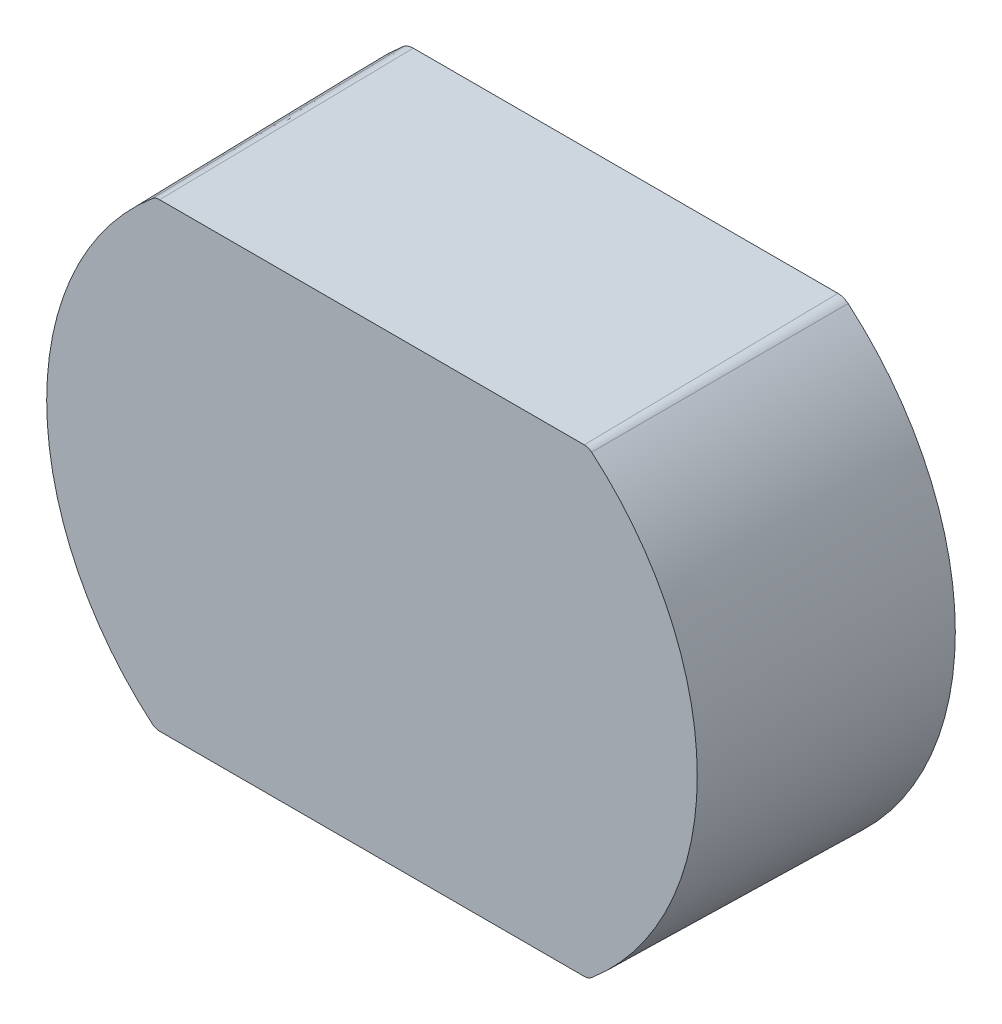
ISO-10303-21;
HEADER;
FILE_DESCRIPTION(('STEP AP214'),'2;1');
FILE_NAME('part.step','',(''),(''),'','','');
FILE_SCHEMA(('AUTOMOTIVE_DESIGN { 1 0 10303 214 1 1 1 1 }'));
ENDSEC;
DATA;
#1=APPLICATION_CONTEXT('core data for automotive mechanical design processes');
#2=APPLICATION_PROTOCOL_DEFINITION('international standard','automotive_design',2000,#1);
#3=PRODUCT_CONTEXT('',#1,'mechanical');
#4=PRODUCT('Part','Part','',(#3));
#5=PRODUCT_RELATED_PRODUCT_CATEGORY('part','',(#4));
#6=PRODUCT_DEFINITION_FORMATION('','',#4);
#7=PRODUCT_DEFINITION_CONTEXT('part definition',#1,'design');
#8=PRODUCT_DEFINITION('design','',#6,#7);
#9=PRODUCT_DEFINITION_SHAPE('','',#8);
#10=(LENGTH_UNIT() NAMED_UNIT(*) SI_UNIT(.MILLI.,.METRE.));
#11=(NAMED_UNIT(*) PLANE_ANGLE_UNIT() SI_UNIT($,.RADIAN.));
#12=(NAMED_UNIT(*) SI_UNIT($,.STERADIAN.) SOLID_ANGLE_UNIT());
#13=UNCERTAINTY_MEASURE_WITH_UNIT(LENGTH_MEASURE(1.E-05),#10,'distance_accuracy_value','');
#14=(GEOMETRIC_REPRESENTATION_CONTEXT(3) GLOBAL_UNCERTAINTY_ASSIGNED_CONTEXT((#13)) GLOBAL_UNIT_ASSIGNED_CONTEXT((#10,
#11,#12)) REPRESENTATION_CONTEXT('',''));
#15=CARTESIAN_POINT('',(0.,0.,0.));
#16=DIRECTION('',(0.,0.,1.));
#17=DIRECTION('',(1.,0.,0.));
#18=AXIS2_PLACEMENT_3D('',#15,#16,#17);
#19=CARTESIAN_POINT('',(-13.3937696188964,13.8001594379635,0.));
#20=DIRECTION('',(0.,0.,-1.));
#21=DIRECTION('',(-1.,0.,0.));
#22=AXIS2_PLACEMENT_3D('',#19,#20,#21);
#23=CONICAL_SURFACE('',#22,0.999837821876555,0.0174532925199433);
#24=CARTESIAN_POINT('',(-13.3937696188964,13.8001594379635,0.));
#25=DIRECTION('',(0.,0.,1.));
#26=DIRECTION('',(-1.,0.,0.));
#27=AXIS2_PLACEMENT_3D('',#24,#25,#26);
#28=CIRCLE('',#27,0.999837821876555);
#29=CARTESIAN_POINT('',(-13.393769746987,14.79999725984,0.));
#30=VERTEX_POINT('',#29);
#31=CARTESIAN_POINT('',(-14.0390708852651,14.563875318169,0.));
#32=VERTEX_POINT('',#31);
#33=EDGE_CURVE('E117',#30,#32,#28,.T.);
#34=ORIENTED_EDGE('',*,*,#33,.T.);
#35=DIRECTION('',(-0.0112638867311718,0.013330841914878,-0.999847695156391));
#36=VECTOR('',#35,1.);
#37=CARTESIAN_POINT('',(-14.0390708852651,14.563875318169,0.));
#38=LINE('',#37,#36);
#39=CARTESIAN_POINT('',(-13.858821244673,14.3505493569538,16.));
#40=VERTEX_POINT('',#39);
#41=EDGE_CURVE('E11',#40,#32,#38,.T.);
#42=ORIENTED_EDGE('',*,*,#41,.F.);
#43=CARTESIAN_POINT('',(-13.3937696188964,13.8001594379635,16.));
#44=DIRECTION('',(0.,0.,-1.));
#45=DIRECTION('',(-1.,0.,0.));
#46=AXIS2_PLACEMENT_3D('',#43,#44,#45);
#47=CIRCLE('',#46,0.720556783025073);
#48=CARTESIAN_POINT('',(-13.3937697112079,14.5207162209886,16.));
#49=VERTEX_POINT('',#48);
#50=EDGE_CURVE('E142',#49,#40,#47,.F.);
#51=ORIENTED_EDGE('',*,*,#50,.F.);
#52=DIRECTION('',(-2.23585101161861E-09,0.0174524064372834,-0.999847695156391));
#53=VECTOR('',#52,1.);
#54=CARTESIAN_POINT('',(-13.393769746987,14.7999972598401,0.));
#55=LINE('',#54,#53);
#56=EDGE_CURVE('E129',#49,#30,#55,.T.);
#57=ORIENTED_EDGE('',*,*,#56,.T.);
#58=EDGE_LOOP('',(#34,#42,#51,#57));
#59=FACE_BOUND('',#58,.T.);
#60=ADVANCED_FACE('F47',(#59),#23,.T.);
#61=CARTESIAN_POINT('',(-1.73333333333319,-1.63528065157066E-12,0.));
#62=DIRECTION('',(0.,0.,-1.));
#63=DIRECTION('',(1.,0.,0.));
#64=AXIS2_PLACEMENT_3D('',#61,#62,#63);
#65=CONICAL_SURFACE('',#64,19.0666630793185,0.0174532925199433);
#66=CARTESIAN_POINT('',(-1.73333333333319,-1.63528065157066E-12,0.));
#67=DIRECTION('',(0.,0.,1.));
#68=DIRECTION('',(1.,0.,0.));
#69=AXIS2_PLACEMENT_3D('',#66,#67,#68);
#70=CIRCLE('',#69,19.0666630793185);
#71=CARTESIAN_POINT('',(-14.0390708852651,-14.5638753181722,0.));
#72=VERTEX_POINT('',#71);
#73=EDGE_CURVE('E113',#32,#72,#70,.T.);
#74=ORIENTED_EDGE('',*,*,#73,.T.);
#75=DIRECTION('',(-0.0112638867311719,-0.0133308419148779,-0.999847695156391));
#76=VECTOR('',#75,1.);
#77=CARTESIAN_POINT('',(-14.0390708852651,-14.5638753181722,0.));
#78=LINE('',#77,#76);
#79=CARTESIAN_POINT('',(-13.858821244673,-14.350549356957,16.));
#80=VERTEX_POINT('',#79);
#81=EDGE_CURVE('E56',#80,#72,#78,.T.);
#82=ORIENTED_EDGE('',*,*,#81,.F.);
#83=CARTESIAN_POINT('',(-1.73333333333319,-1.63528065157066E-12,16.));
#84=DIRECTION('',(0.,0.,-1.));
#85=DIRECTION('',(-1.,0.,0.));
#86=AXIS2_PLACEMENT_3D('',#83,#84,#85);
#87=CIRCLE('',#86,18.787382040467);
#88=EDGE_CURVE('E125',#40,#80,#87,.F.);
#89=ORIENTED_EDGE('',*,*,#88,.F.);
#90=ORIENTED_EDGE('',*,*,#41,.T.);
#91=EDGE_LOOP('',(#74,#82,#89,#90));
#92=FACE_BOUND('',#91,.T.);
#93=ADVANCED_FACE('F49',(#92),#65,.T.);
#94=CARTESIAN_POINT('',(-13.3937696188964,-13.8001594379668,0.));
#95=DIRECTION('',(0.,0.,-1.));
#96=DIRECTION('',(1.,0.,0.));
#97=AXIS2_PLACEMENT_3D('',#94,#95,#96);
#98=CONICAL_SURFACE('',#97,0.999837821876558,0.0174532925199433);
#99=CARTESIAN_POINT('',(-13.3937696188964,-13.8001594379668,0.));
#100=DIRECTION('',(0.,0.,1.));
#101=DIRECTION('',(1.,0.,0.));
#102=AXIS2_PLACEMENT_3D('',#99,#100,#101);
#103=CIRCLE('',#102,0.999837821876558);
#104=CARTESIAN_POINT('',(-13.393769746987,-14.7999972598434,0.));
#105=VERTEX_POINT('',#104);
#106=EDGE_CURVE('E119',#72,#105,#103,.T.);
#107=ORIENTED_EDGE('',*,*,#106,.T.);
#108=DIRECTION('',(-2.2358509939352E-09,-0.0174524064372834,-0.999847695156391));
#109=VECTOR('',#108,1.);
#110=CARTESIAN_POINT('',(-13.393769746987,-14.7999972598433,0.));
#111=LINE('',#110,#109);
#112=CARTESIAN_POINT('',(-13.3937697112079,-14.5207162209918,16.));
#113=VERTEX_POINT('',#112);
#114=EDGE_CURVE('E157',#113,#105,#111,.T.);
#115=ORIENTED_EDGE('',*,*,#114,.F.);
#116=CARTESIAN_POINT('',(-13.3937696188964,-13.8001594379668,16.));
#117=DIRECTION('',(0.,0.,-1.));
#118=DIRECTION('',(-1.,0.,0.));
#119=AXIS2_PLACEMENT_3D('',#116,#117,#118);
#120=CIRCLE('',#119,0.720556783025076);
#121=EDGE_CURVE('E163',#80,#113,#120,.F.);
#122=ORIENTED_EDGE('',*,*,#121,.F.);
#123=ORIENTED_EDGE('',*,*,#81,.T.);
#124=EDGE_LOOP('',(#107,#115,#122,#123));
#125=FACE_BOUND('',#124,.T.);
#126=ADVANCED_FACE('F186',(#125),#98,.T.);
#127=CARTESIAN_POINT('',(-13.393769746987,-14.7999972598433,0.));
#128=DIRECTION('',(-1.28091817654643E-07,-0.999847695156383,0.0174524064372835));
#129=DIRECTION('',(0.,-0.0174524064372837,-0.999847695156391));
#130=AXIS2_PLACEMENT_3D('',#127,#128,#129);
#131=PLANE('',#130);
#132=DIRECTION('',(0.999999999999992,-1.28111329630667E-07,0.));
#133=VECTOR('',#132,1.);
#134=CARTESIAN_POINT('',(-13.393769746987,-14.7999972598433,0.));
#135=LINE('',#134,#133);
#136=CARTESIAN_POINT('',(13.3937694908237,-14.8000006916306,0.));
#137=VERTEX_POINT('',#136);
#138=EDGE_CURVE('E133',#105,#137,#135,.T.);
#139=ORIENTED_EDGE('',*,*,#138,.T.);
#140=DIRECTION('',(-2.23585095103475E-09,-0.0174524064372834,-0.999847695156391));
#141=VECTOR('',#140,1.);
#142=CARTESIAN_POINT('',(13.3937694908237,-14.8000006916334,0.));
#143=LINE('',#142,#141);
#144=CARTESIAN_POINT('',(13.3937695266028,-14.5207196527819,16.));
#145=VERTEX_POINT('',#144);
#146=EDGE_CURVE('E154',#145,#137,#143,.T.);
#147=ORIENTED_EDGE('',*,*,#146,.F.);
#148=DIRECTION('',(-0.999999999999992,1.28111329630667E-07,0.));
#149=VECTOR('',#148,1.);
#150=CARTESIAN_POINT('',(-13.3937732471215,-14.5207162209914,16.));
#151=LINE('',#150,#149);
#152=EDGE_CURVE('E165',#113,#145,#151,.F.);
#153=ORIENTED_EDGE('',*,*,#152,.F.);
#154=ORIENTED_EDGE('',*,*,#114,.T.);
#155=EDGE_LOOP('',(#139,#147,#153,#154));
#156=FACE_BOUND('',#155,.T.);
#157=ADVANCED_FACE('F190',(#156),#131,.T.);
#158=CARTESIAN_POINT('',(13.3937696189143,-13.8001628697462,0.));
#159=DIRECTION('',(0.,0.,-1.));
#160=DIRECTION('',(1.,0.,0.));
#161=AXIS2_PLACEMENT_3D('',#158,#159,#160);
#162=CONICAL_SURFACE('',#161,0.999837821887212,0.0174532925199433);
#163=CARTESIAN_POINT('',(13.3937696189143,-13.8001628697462,0.));
#164=DIRECTION('',(0.,0.,1.));
#165=DIRECTION('',(1.,0.,0.));
#166=AXIS2_PLACEMENT_3D('',#163,#164,#165);
#167=CIRCLE('',#166,0.999837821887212);
#168=CARTESIAN_POINT('',(14.0390707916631,-14.5638788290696,0.));
#169=VERTEX_POINT('',#168);
#170=EDGE_CURVE('E135',#137,#169,#167,.T.);
#171=ORIENTED_EDGE('',*,*,#170,.T.);
#172=DIRECTION('',(0.0112638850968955,-0.0133308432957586,-0.999847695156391));
#173=VECTOR('',#172,1.);
#174=CARTESIAN_POINT('',(14.0390707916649,-14.5638788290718,0.));
#175=LINE('',#174,#173);
#176=CARTESIAN_POINT('',(13.8588211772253,-14.3505528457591,16.));
#177=VERTEX_POINT('',#176);
#178=EDGE_CURVE('E151',#177,#169,#175,.T.);
#179=ORIENTED_EDGE('',*,*,#178,.F.);
#180=CARTESIAN_POINT('',(13.3937696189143,-13.8001628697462,16.));
#181=DIRECTION('',(0.,0.,-1.));
#182=DIRECTION('',(-1.,0.,0.));
#183=AXIS2_PLACEMENT_3D('',#180,#181,#182);
#184=CIRCLE('',#183,0.72055678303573);
#185=EDGE_CURVE('E167',#145,#177,#184,.F.);
#186=ORIENTED_EDGE('',*,*,#185,.F.);
#187=ORIENTED_EDGE('',*,*,#146,.T.);
#188=EDGE_LOOP('',(#171,#179,#186,#187));
#189=FACE_BOUND('',#188,.T.);
#190=ADVANCED_FACE('F193',(#189),#162,.T.);
#191=CARTESIAN_POINT('',(1.73333333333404,-1.63528065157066E-12,0.));
#192=DIRECTION('',(0.,0.,-1.));
#193=DIRECTION('',(1.,0.,0.));
#194=AXIS2_PLACEMENT_3D('',#191,#192,#193);
#195=CONICAL_SURFACE('',#194,19.0666657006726,0.0174532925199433);
#196=CARTESIAN_POINT('',(1.73333333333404,-1.63528065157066E-12,0.));
#197=DIRECTION('',(0.,0.,1.));
#198=DIRECTION('',(1.,0.,0.));
#199=AXIS2_PLACEMENT_3D('',#196,#197,#198);
#200=CIRCLE('',#199,19.0666657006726);
#201=CARTESIAN_POINT('',(14.0390707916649,14.5638788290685,0.));
#202=VERTEX_POINT('',#201);
#203=EDGE_CURVE('E137',#169,#202,#200,.T.);
#204=ORIENTED_EDGE('',*,*,#203,.T.);
#205=DIRECTION('',(0.0112638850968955,0.0133308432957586,-0.999847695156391));
#206=VECTOR('',#205,1.);
#207=CARTESIAN_POINT('',(14.0390707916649,14.5638788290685,0.));
#208=LINE('',#207,#206);
#209=CARTESIAN_POINT('',(13.8588211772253,14.3505528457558,16.));
#210=VERTEX_POINT('',#209);
#211=EDGE_CURVE('E148',#210,#202,#208,.T.);
#212=ORIENTED_EDGE('',*,*,#211,.F.);
#213=CARTESIAN_POINT('',(1.73333333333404,-1.63528065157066E-12,16.));
#214=DIRECTION('',(0.,0.,-1.));
#215=DIRECTION('',(-1.,0.,0.));
#216=AXIS2_PLACEMENT_3D('',#213,#214,#215);
#217=CIRCLE('',#216,18.7873846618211);
#218=EDGE_CURVE('E169',#177,#210,#217,.F.);
#219=ORIENTED_EDGE('',*,*,#218,.F.);
#220=ORIENTED_EDGE('',*,*,#178,.T.);
#221=EDGE_LOOP('',(#204,#212,#219,#220));
#222=FACE_BOUND('',#221,.T.);
#223=ADVANCED_FACE('F176',(#222),#195,.T.);
#224=CARTESIAN_POINT('',(13.3937696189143,13.800162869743,0.));
#225=DIRECTION('',(0.,0.,-1.));
#226=DIRECTION('',(-1.,0.,0.));
#227=AXIS2_PLACEMENT_3D('',#224,#225,#226);
#228=CONICAL_SURFACE('',#227,0.999837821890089,0.0174532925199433);
#229=CARTESIAN_POINT('',(13.3937696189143,13.800162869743,0.));
#230=DIRECTION('',(0.,0.,1.));
#231=DIRECTION('',(-1.,0.,0.));
#232=AXIS2_PLACEMENT_3D('',#229,#230,#231);
#233=CIRCLE('',#232,0.999837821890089);
#234=CARTESIAN_POINT('',(13.3937694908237,14.800000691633,0.));
#235=VERTEX_POINT('',#234);
#236=EDGE_CURVE('E139',#202,#235,#233,.T.);
#237=ORIENTED_EDGE('',*,*,#236,.T.);
#238=DIRECTION('',(-2.23585471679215E-09,0.0174524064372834,-0.999847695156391));
#239=VECTOR('',#238,1.);
#240=CARTESIAN_POINT('',(13.3937694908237,14.800000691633,0.));
#241=LINE('',#240,#239);
#242=CARTESIAN_POINT('',(13.3937695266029,14.5207196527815,16.));
#243=VERTEX_POINT('',#242);
#244=EDGE_CURVE('E145',#243,#235,#241,.T.);
#245=ORIENTED_EDGE('',*,*,#244,.F.);
#246=CARTESIAN_POINT('',(13.3937696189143,13.800162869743,16.));
#247=DIRECTION('',(0.,0.,-1.));
#248=DIRECTION('',(-1.,0.,0.));
#249=AXIS2_PLACEMENT_3D('',#246,#247,#248);
#250=CIRCLE('',#249,0.720556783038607);
#251=EDGE_CURVE('E68',#210,#243,#250,.F.);
#252=ORIENTED_EDGE('',*,*,#251,.F.);
#253=ORIENTED_EDGE('',*,*,#211,.T.);
#254=EDGE_LOOP('',(#237,#245,#252,#253));
#255=FACE_BOUND('',#254,.T.);
#256=ADVANCED_FACE('F180',(#255),#228,.T.);
#257=CARTESIAN_POINT('',(-13.393769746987,14.79999725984,0.));
#258=DIRECTION('',(-1.28092030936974E-07,0.999847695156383,0.0174524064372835));
#259=DIRECTION('',(0.,-0.0174524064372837,0.999847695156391));
#260=AXIS2_PLACEMENT_3D('',#257,#258,#259);
#261=PLANE('',#260);
#262=DIRECTION('',(-0.999999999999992,-1.28111542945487E-07,0.));
#263=VECTOR('',#262,1.);
#264=CARTESIAN_POINT('',(-13.393769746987,14.79999725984,0.));
#265=LINE('',#264,#263);
#266=EDGE_CURVE('E141',#235,#30,#265,.T.);
#267=ORIENTED_EDGE('',*,*,#266,.T.);
#268=ORIENTED_EDGE('',*,*,#56,.F.);
#269=DIRECTION('',(0.999999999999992,1.28111542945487E-07,0.));
#270=VECTOR('',#269,1.);
#271=CARTESIAN_POINT('',(-13.3937697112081,14.5207162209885,16.));
#272=LINE('',#271,#270);
#273=EDGE_CURVE('E51',#243,#49,#272,.F.);
#274=ORIENTED_EDGE('',*,*,#273,.F.);
#275=ORIENTED_EDGE('',*,*,#244,.T.);
#276=EDGE_LOOP('',(#267,#268,#274,#275));
#277=FACE_BOUND('',#276,.T.);
#278=ADVANCED_FACE('F182',(#277),#261,.T.);
#279=CARTESIAN_POINT('',(-13.3937696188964,13.8001594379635,16.));
#280=DIRECTION('',(0.,0.,-1.));
#281=DIRECTION('',(-1.,0.,0.));
#282=AXIS2_PLACEMENT_3D('',#279,#280,#281);
#283=PLANE('',#282);
#284=ORIENTED_EDGE('',*,*,#50,.T.);
#285=ORIENTED_EDGE('',*,*,#88,.T.);
#286=ORIENTED_EDGE('',*,*,#121,.T.);
#287=ORIENTED_EDGE('',*,*,#152,.T.);
#288=ORIENTED_EDGE('',*,*,#185,.T.);
#289=ORIENTED_EDGE('',*,*,#218,.T.);
#290=ORIENTED_EDGE('',*,*,#251,.T.);
#291=ORIENTED_EDGE('',*,*,#273,.T.);
#292=EDGE_LOOP('',(#284,#285,#286,#287,#288,#289,#290,#291));
#293=FACE_BOUND('',#292,.T.);
#294=ADVANCED_FACE('F172',(#293),#283,.F.);
#295=CARTESIAN_POINT('',(-13.3937696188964,13.8001594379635,0.));
#296=DIRECTION('',(0.,0.,-1.));
#297=DIRECTION('',(-1.,0.,0.));
#298=AXIS2_PLACEMENT_3D('',#295,#296,#297);
#299=PLANE('',#298);
#300=ORIENTED_EDGE('',*,*,#33,.F.);
#301=ORIENTED_EDGE('',*,*,#266,.F.);
#302=ORIENTED_EDGE('',*,*,#236,.F.);
#303=ORIENTED_EDGE('',*,*,#203,.F.);
#304=ORIENTED_EDGE('',*,*,#170,.F.);
#305=ORIENTED_EDGE('',*,*,#138,.F.);
#306=ORIENTED_EDGE('',*,*,#106,.F.);
#307=ORIENTED_EDGE('',*,*,#73,.F.);
#308=EDGE_LOOP('',(#300,#301,#302,#303,#304,#305,#306,#307));
#309=FACE_BOUND('',#308,.T.);
#310=ADVANCED_FACE('F114',(#309),#299,.T.);
#311=CLOSED_SHELL('',(#60,#93,#126,#157,#190,#223,#256,#278,#294,#310));
#312=MANIFOLD_SOLID_BREP('B2',#311);
#313=ADVANCED_BREP_SHAPE_REPRESENTATION('',(#18,#312),#14);
#314=SHAPE_DEFINITION_REPRESENTATION(#9,#313);
ENDSEC;
END-ISO-10303-21;
